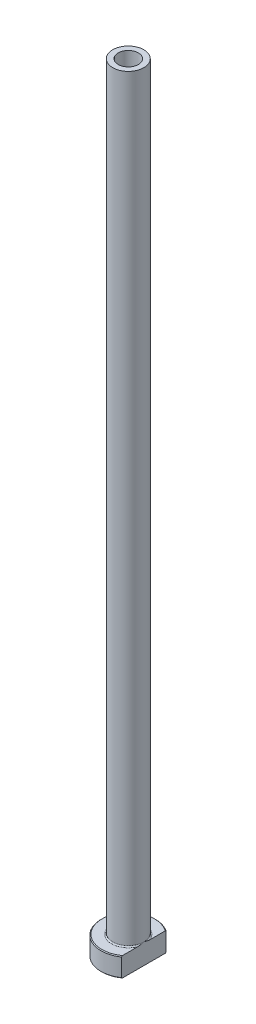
from build123d import *

# Parameters (mm, degrees)
FILLET1_R          = 0.3
CHAMFER1_SIZE      = 0.2
CUT_EXTRUDE1_DEPTH = 201.244850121
CHAMFER2_SIZE      = 0.5


with BuildPart() as part:
    # Sketch1 → Revolve1 (revolve)
    with BuildSketch(Plane.XY, mode=Mode.PRIVATE) as revolve1_sk:
        Polygon((-2.6, 200), (-4, 200), (-4, 5), (-7, 5), (-7, 0), (-2.85, 0), (-2.85, 143), (-2.6, 155), align=None)
    revolve(revolve1_sk.sketch.rotate(Axis((0, 92.187680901, 0), (0, -1, 0)), 270), axis=Axis((0, 92.187680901, 0), (0, -1, 0)))

    # Fillet1
    fillet1_edges = [part.edges().sort_by_distance(p)[0] for p in [
        (0, 5, -4),
    ]]
    fillet(fillet1_edges, radius=FILLET1_R)

    # Chamfer1
    chamfer1_edges = [part.edges().sort_by_distance(p)[0] for p in [
        (0, 0, -7),
        (0, 5, -7),
    ]]
    chamfer(chamfer1_edges, length=CHAMFER1_SIZE)

    # Sketch2 → Cut-Extrude1 (cut, through all)
    with BuildSketch(Plane.XZ):
        with BuildLine():
            Line((4, 5.744562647), (4, -5.744562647))
            ThreePointArc((4, -5.744562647), (7, 0), (4, 5.744562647))
        make_face()
    extrude(amount=-CUT_EXTRUDE1_DEPTH, mode=Mode.SUBTRACT)

    # Chamfer2
    chamfer2_edges = [part.edges().sort_by_distance(p)[0] for p in [
        (0, 0, -2.85),
    ]]
    chamfer(chamfer2_edges, length=CHAMFER2_SIZE)


solid = part.part
